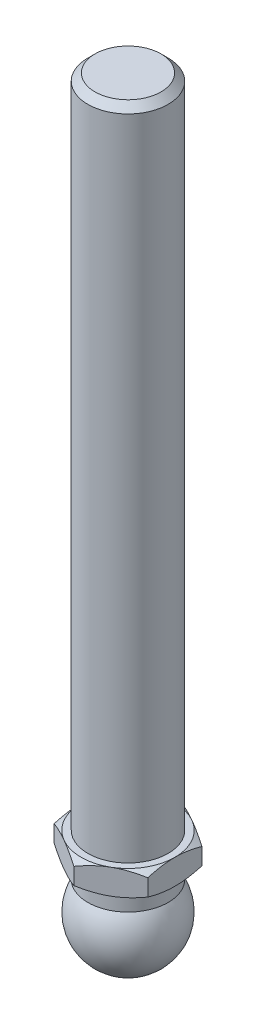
ISO-10303-21;
HEADER;
FILE_DESCRIPTION(('STEP AP214'),'2;1');
FILE_NAME('part.step','',(''),(''),'','','');
FILE_SCHEMA(('AUTOMOTIVE_DESIGN { 1 0 10303 214 1 1 1 1 }'));
ENDSEC;
DATA;
#1=APPLICATION_CONTEXT('core data for automotive mechanical design processes');
#2=APPLICATION_PROTOCOL_DEFINITION('international standard','automotive_design',2000,#1);
#3=PRODUCT_CONTEXT('',#1,'mechanical');
#4=PRODUCT('Part','Part','',(#3));
#5=PRODUCT_RELATED_PRODUCT_CATEGORY('part','',(#4));
#6=PRODUCT_DEFINITION_FORMATION('','',#4);
#7=PRODUCT_DEFINITION_CONTEXT('part definition',#1,'design');
#8=PRODUCT_DEFINITION('design','',#6,#7);
#9=PRODUCT_DEFINITION_SHAPE('','',#8);
#10=(LENGTH_UNIT() NAMED_UNIT(*) SI_UNIT(.MILLI.,.METRE.));
#11=(NAMED_UNIT(*) PLANE_ANGLE_UNIT() SI_UNIT($,.RADIAN.));
#12=(NAMED_UNIT(*) SI_UNIT($,.STERADIAN.) SOLID_ANGLE_UNIT());
#13=UNCERTAINTY_MEASURE_WITH_UNIT(LENGTH_MEASURE(1.E-05),#10,'distance_accuracy_value','');
#14=(GEOMETRIC_REPRESENTATION_CONTEXT(3) GLOBAL_UNCERTAINTY_ASSIGNED_CONTEXT((#13)) GLOBAL_UNIT_ASSIGNED_CONTEXT((#10,
#11,#12)) REPRESENTATION_CONTEXT('',''));
#15=CARTESIAN_POINT('',(0.,0.,0.));
#16=DIRECTION('',(0.,0.,1.));
#17=DIRECTION('',(1.,0.,0.));
#18=AXIS2_PLACEMENT_3D('',#15,#16,#17);
#19=CARTESIAN_POINT('',(0.,10.55,0.));
#20=DIRECTION('',(0.,-1.,0.));
#21=DIRECTION('',(0.,0.,-1.));
#22=AXIS2_PLACEMENT_3D('',#19,#20,#21);
#23=CONICAL_SURFACE('',#22,7.,1.0471975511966);
#24=CARTESIAN_POINT('',(-7.,6.48828268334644,12.1648696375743));
#25=CARTESIAN_POINT('',(-7.,6.63391573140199,11.8738003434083));
#26=CARTESIAN_POINT('',(-7.,6.77854589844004,11.5822239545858));
#27=CARTESIAN_POINT('',(-7.,7.06531569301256,10.997825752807));
#28=CARTESIAN_POINT('',(-7.,7.20745515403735,10.7050038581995));
#29=CARTESIAN_POINT('',(-7.,7.48902214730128,10.1173316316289));
#30=CARTESIAN_POINT('',(-7.,7.62844364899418,9.82247840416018));
#31=CARTESIAN_POINT('',(-7.,7.90360604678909,9.2310632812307));
#32=CARTESIAN_POINT('',(-7.,8.03934701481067,8.93450141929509));
#33=CARTESIAN_POINT('',(-7.,8.31231104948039,8.32593520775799));
#34=CARTESIAN_POINT('',(-7.,8.44932547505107,8.01383696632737));
#35=CARTESIAN_POINT('',(-7.,8.71713837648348,7.38695797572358));
#36=CARTESIAN_POINT('',(-7.,8.84793657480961,7.07217710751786));
#37=CARTESIAN_POINT('',(-7.,9.10155301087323,6.43962449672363));
#38=CARTESIAN_POINT('',(-7.,9.224376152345,6.12185473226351));
#39=CARTESIAN_POINT('',(-7.,9.45990162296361,5.48260317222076));
#40=CARTESIAN_POINT('',(-7.,9.57260505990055,5.16112178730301));
#41=CARTESIAN_POINT('',(-7.,9.80990146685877,4.43821731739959));
#42=CARTESIAN_POINT('',(-7.,9.93111814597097,4.03566892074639));
#43=CARTESIAN_POINT('',(-7.,10.1469740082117,3.22331060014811));
#44=CARTESIAN_POINT('',(-7.,10.2416155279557,2.81350131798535));
#45=CARTESIAN_POINT('',(-7.,10.3569999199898,2.19742561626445));
#46=CARTESIAN_POINT('',(-7.,10.3908518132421,1.99359214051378));
#47=CARTESIAN_POINT('',(-7.,10.4493191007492,1.58461613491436));
#48=CARTESIAN_POINT('',(-7.,10.4739358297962,1.37947379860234));
#49=CARTESIAN_POINT('',(-7.,10.5131968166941,0.968289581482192));
#50=CARTESIAN_POINT('',(-7.,10.5278439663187,0.762247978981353));
#51=CARTESIAN_POINT('',(-7.,10.5467021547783,0.349683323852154));
#52=CARTESIAN_POINT('',(-7.,10.5509132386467,0.143160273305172));
#53=CARTESIAN_POINT('',(-7.,10.5487493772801,-0.271082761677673));
#54=CARTESIAN_POINT('',(-7.,10.5423100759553,-0.478802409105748));
#55=CARTESIAN_POINT('',(-7.,10.5189433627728,-0.893645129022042));
#56=CARTESIAN_POINT('',(-7.,10.5020159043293,-1.1007681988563));
#57=CARTESIAN_POINT('',(-7.,10.4582124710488,-1.51403043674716));
#58=CARTESIAN_POINT('',(-7.,10.4313327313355,-1.72016920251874));
#59=CARTESIAN_POINT('',(-7.,10.3684180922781,-2.13103319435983));
#60=CARTESIAN_POINT('',(-7.,10.3323828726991,-2.33575837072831));
#61=CARTESIAN_POINT('',(-7.,10.2105686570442,-2.95437912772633));
#62=CARTESIAN_POINT('',(-7.,10.1118729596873,-3.3657507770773));
#63=CARTESIAN_POINT('',(-7.,9.88845338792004,-4.18138012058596));
#64=CARTESIAN_POINT('',(-7.,9.76371481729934,-4.58563365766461));
#65=CARTESIAN_POINT('',(-7.,9.52332483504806,-5.30320893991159));
#66=CARTESIAN_POINT('',(-7.,9.41128759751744,-5.61775957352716));
#67=CARTESIAN_POINT('',(-7.,9.17785144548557,-6.24325021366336));
#68=CARTESIAN_POINT('',(-7.,9.05645511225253,-6.55419118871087));
#69=CARTESIAN_POINT('',(-7.,8.80620704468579,-7.17328528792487));
#70=CARTESIAN_POINT('',(-7.,8.67735033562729,-7.48143638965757));
#71=CARTESIAN_POINT('',(-7.,8.41378231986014,-8.09523802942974));
#72=CARTESIAN_POINT('',(-7.,8.27907065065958,-8.40088841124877));
#73=CARTESIAN_POINT('',(-7.,8.01078407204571,-8.99716345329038));
#74=CARTESIAN_POINT('',(-7.,7.87740317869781,-9.28787568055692));
#75=CARTESIAN_POINT('',(-7.,7.60714715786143,-9.86766295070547));
#76=CARTESIAN_POINT('',(-7.,7.47027208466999,-10.1567380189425));
#77=CARTESIAN_POINT('',(-7.,7.19389786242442,-10.7329937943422));
#78=CARTESIAN_POINT('',(-7.,7.05440383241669,-11.0201769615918));
#79=CARTESIAN_POINT('',(-7.,6.77302286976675,-11.5933594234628));
#80=CARTESIAN_POINT('',(-7.,6.63113600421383,-11.879358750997));
#81=CARTESIAN_POINT('',(-7.,6.48828268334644,-12.1648696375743));
#82=B_SPLINE_CURVE_WITH_KNOTS('',3,(#24,#25,#26,#27,#28,#29,#30,#31,#32,#33,#34,#35,#36,#37,#38,
#39,#40,#41,#42,#43,#44,#45,#46,#47,#48,#49,#50,#51,#52,#53,#54,#55,#56,#57,#58,#59,#60,#61,#62,
#63,#64,#65,#66,#67,#68,#69,#70,#71,#72,#73,#74,#75,#76,#77,#78,#79,#80,#81),.UNSPECIFIED.,.F.,
.F.,(4,2,2,2,2,2,2,2,2,2,2,2,2,2,2,2,2,2,2,2,2,2,2,2,2,2,2,2,4),(0.,0.976413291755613,
1.95289161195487,2.93133423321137,3.90975772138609,4.93225217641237,5.95479223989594,
6.97669748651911,7.99849072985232,9.25906449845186,10.5195273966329,11.1392271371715,
11.7588372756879,12.3782676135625,12.9976952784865,13.6208795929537,14.2440666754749,
14.8674897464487,15.490934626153,16.758797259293,18.0273773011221,19.0289263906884,
20.0302002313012,21.0321496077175,22.0341611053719,22.9936838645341,23.9531917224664,
24.9109871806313,25.8687558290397),.UNSPECIFIED.);
#83=CARTESIAN_POINT('',(-7.,9.92478521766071,4.04145188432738));
#84=VERTEX_POINT('',#83);
#85=CARTESIAN_POINT('',(-7.,10.55,0.));
#86=VERTEX_POINT('',#85);
#87=EDGE_CURVE('E313',#84,#86,#82,.T.);
#88=ORIENTED_EDGE('',*,*,#87,.F.);
#89=CARTESIAN_POINT('',(0.0002,9.9247185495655,8.0830192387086));
#90=CARTESIAN_POINT('',(-0.153667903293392,9.97600015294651,7.99418356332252));
#91=CARTESIAN_POINT('',(-0.30810950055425,10.0249544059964,7.90501666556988));
#92=CARTESIAN_POINT('',(-0.618246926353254,10.1175672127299,7.72595873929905));
#93=CARTESIAN_POINT('',(-0.773943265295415,10.1612234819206,7.63606741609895));
#94=CARTESIAN_POINT('',(-1.24352516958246,10.2833884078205,7.36495417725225));
#95=CARTESIAN_POINT('',(-1.5592643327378,10.3528744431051,7.18266208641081));
#96=CARTESIAN_POINT('',(-2.03176224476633,10.4343550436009,6.9098652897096));
#97=CARTESIAN_POINT('',(-2.18710922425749,10.4575665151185,6.82017566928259));
#98=CARTESIAN_POINT('',(-2.49850511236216,10.4964887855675,6.64039116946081));
#99=CARTESIAN_POINT('',(-2.65455395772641,10.5122002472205,6.55029632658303));
#100=CARTESIAN_POINT('',(-2.96692267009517,10.5357220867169,6.36995016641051));
#101=CARTESIAN_POINT('',(-3.12324202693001,10.5435414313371,6.27969914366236));
#102=CARTESIAN_POINT('',(-3.43601650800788,10.5511197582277,6.09911871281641));
#103=CARTESIAN_POINT('',(-3.59247162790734,10.550878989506,6.00878930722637));
#104=CARTESIAN_POINT('',(-4.02110687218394,10.5391402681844,5.76131663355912));
#105=CARTESIAN_POINT('',(-4.2931466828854,10.5194342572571,5.60425437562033));
#106=CARTESIAN_POINT('',(-4.8354194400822,10.4569465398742,5.29117305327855));
#107=CARTESIAN_POINT('',(-5.10565047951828,10.414143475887,5.13515508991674));
#108=CARTESIAN_POINT('',(-5.64901454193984,10.3071483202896,4.82144370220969));
#109=CARTESIAN_POINT('',(-5.92207900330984,10.2425029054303,4.66378986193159));
#110=CARTESIAN_POINT('',(-6.46413578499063,10.095783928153,4.35083323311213));
#111=CARTESIAN_POINT('',(-6.73313504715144,10.0137448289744,4.19552643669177));
#112=CARTESIAN_POINT('',(-7.0002,9.9247185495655,4.04133641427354));
#113=B_SPLINE_CURVE_WITH_KNOTS('',3,(#89,#90,#91,#92,#93,#94,#95,#96,#97,#98,#99,#100,#101,#102,
#103,#104,#105,#106,#107,#108,#109,#110,#111,#112),.UNSPECIFIED.,.F.,.F.,(4,2,2,2,2,2,2,2,2,2,2,
4),(0.,0.554727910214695,1.10969417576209,2.2219327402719,2.76443041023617,3.30688013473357,
3.8487128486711,4.39052882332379,5.33376515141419,6.27787517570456,7.2429241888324,
8.20607866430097),.UNSPECIFIED.);
#114=CARTESIAN_POINT('',(-3.5,10.55,6.06217782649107));
#115=VERTEX_POINT('',#114);
#116=EDGE_CURVE('E135',#115,#84,#113,.T.);
#117=ORIENTED_EDGE('',*,*,#116,.F.);
#118=CARTESIAN_POINT('',(0.,10.55,0.));
#119=DIRECTION('',(0.,-1.,0.));
#120=DIRECTION('',(0.,0.,-1.));
#121=AXIS2_PLACEMENT_3D('',#118,#119,#120);
#122=CIRCLE('',#121,7.);
#123=EDGE_CURVE('E283',#115,#86,#122,.T.);
#124=ORIENTED_EDGE('',*,*,#123,.T.);
#125=EDGE_LOOP('',(#88,#117,#124));
#126=FACE_BOUND('',#125,.T.);
#127=ADVANCED_FACE('F14',(#126),#23,.T.);
#128=CARTESIAN_POINT('',(-7.,9.92478521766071,-4.04145188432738));
#129=VERTEX_POINT('',#128);
#130=EDGE_CURVE('E193',#86,#129,#82,.T.);
#131=ORIENTED_EDGE('',*,*,#130,.F.);
#132=CARTESIAN_POINT('',(-3.5,10.55,-6.06217782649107));
#133=VERTEX_POINT('',#132);
#134=EDGE_CURVE('E195',#86,#133,#122,.T.);
#135=ORIENTED_EDGE('',*,*,#134,.T.);
#136=CARTESIAN_POINT('',(-7.0002,9.9247185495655,-4.04133641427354));
#137=CARTESIAN_POINT('',(-6.84633209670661,9.97600015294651,-4.13017208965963));
#138=CARTESIAN_POINT('',(-6.69189049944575,10.0249544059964,-4.21933898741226));
#139=CARTESIAN_POINT('',(-6.38175307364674,10.1175672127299,-4.39839691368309));
#140=CARTESIAN_POINT('',(-6.22605673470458,10.1612234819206,-4.48828823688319));
#141=CARTESIAN_POINT('',(-5.75647483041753,10.2833884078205,-4.75940147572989));
#142=CARTESIAN_POINT('',(-5.4407356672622,10.352874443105,-4.94169356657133));
#143=CARTESIAN_POINT('',(-4.96823775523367,10.4343550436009,-5.21449036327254));
#144=CARTESIAN_POINT('',(-4.81289077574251,10.4575665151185,-5.30417998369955));
#145=CARTESIAN_POINT('',(-4.50149488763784,10.4964887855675,-5.48396448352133));
#146=CARTESIAN_POINT('',(-4.34544604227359,10.5122002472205,-5.57405932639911));
#147=CARTESIAN_POINT('',(-4.03307732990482,10.5357220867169,-5.75440548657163));
#148=CARTESIAN_POINT('',(-3.87675797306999,10.5435414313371,-5.84465650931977));
#149=CARTESIAN_POINT('',(-3.56398349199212,10.5511197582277,-6.02523694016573));
#150=CARTESIAN_POINT('',(-3.40752837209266,10.550878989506,-6.11556634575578));
#151=CARTESIAN_POINT('',(-2.97889312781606,10.5391402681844,-6.36303901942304));
#152=CARTESIAN_POINT('',(-2.7068533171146,10.5194342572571,-6.52010127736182));
#153=CARTESIAN_POINT('',(-2.1645805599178,10.4569465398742,-6.83318259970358));
#154=CARTESIAN_POINT('',(-1.89434952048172,10.414143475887,-6.9892005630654));
#155=CARTESIAN_POINT('',(-1.35098545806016,10.3071483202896,-7.30291195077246));
#156=CARTESIAN_POINT('',(-1.07792099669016,10.2425029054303,-7.46056579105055));
#157=CARTESIAN_POINT('',(-0.53586421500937,10.095783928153,-7.77352241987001));
#158=CARTESIAN_POINT('',(-0.266864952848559,10.0137448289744,-7.92882921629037));
#159=CARTESIAN_POINT('',(0.000199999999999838,9.9247185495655,-8.0830192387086));
#160=B_SPLINE_CURVE_WITH_KNOTS('',3,(#136,#137,#138,#139,#140,#141,#142,#143,#144,#145,#146,
#147,#148,#149,#150,#151,#152,#153,#154,#155,#156,#157,#158,#159),.UNSPECIFIED.,.F.,.F.,(4,2,2,
2,2,2,2,2,2,2,2,4),(0.,0.554727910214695,1.10969417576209,2.2219327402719,2.76443041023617,
3.30688013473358,3.8487128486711,4.39052882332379,5.33376515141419,6.27787517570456,
7.2429241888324,8.20607866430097),.UNSPECIFIED.);
#161=EDGE_CURVE('E183',#129,#133,#160,.T.);
#162=ORIENTED_EDGE('',*,*,#161,.F.);
#163=EDGE_LOOP('',(#131,#135,#162));
#164=FACE_BOUND('',#163,.T.);
#165=ADVANCED_FACE('F192',(#164),#23,.T.);
#166=CARTESIAN_POINT('',(0.,9.92478521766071,-8.08290376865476));
#167=VERTEX_POINT('',#166);
#168=EDGE_CURVE('E197',#133,#167,#160,.T.);
#169=ORIENTED_EDGE('',*,*,#168,.F.);
#170=CARTESIAN_POINT('',(3.5,10.55,-6.06217782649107));
#171=VERTEX_POINT('',#170);
#172=EDGE_CURVE('E293',#133,#171,#122,.T.);
#173=ORIENTED_EDGE('',*,*,#172,.T.);
#174=CARTESIAN_POINT('',(-0.0002,9.9247185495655,-8.0830192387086));
#175=CARTESIAN_POINT('',(0.153667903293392,9.97600015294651,-7.99418356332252));
#176=CARTESIAN_POINT('',(0.30810950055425,10.0249544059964,-7.90501666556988));
#177=CARTESIAN_POINT('',(0.618246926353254,10.1175672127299,-7.72595873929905));
#178=CARTESIAN_POINT('',(0.773943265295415,10.1612234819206,-7.63606741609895));
#179=CARTESIAN_POINT('',(1.24352516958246,10.2833884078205,-7.36495417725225));
#180=CARTESIAN_POINT('',(1.5592643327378,10.3528744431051,-7.18266208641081));
#181=CARTESIAN_POINT('',(2.03176224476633,10.4343550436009,-6.9098652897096));
#182=CARTESIAN_POINT('',(2.18710922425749,10.4575665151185,-6.82017566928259));
#183=CARTESIAN_POINT('',(2.49850511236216,10.4964887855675,-6.64039116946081));
#184=CARTESIAN_POINT('',(2.65455395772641,10.5122002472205,-6.55029632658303));
#185=CARTESIAN_POINT('',(2.96692267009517,10.5357220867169,-6.36995016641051));
#186=CARTESIAN_POINT('',(3.12324202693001,10.5435414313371,-6.27969914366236));
#187=CARTESIAN_POINT('',(3.43601650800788,10.5511197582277,-6.09911871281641));
#188=CARTESIAN_POINT('',(3.59247162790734,10.550878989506,-6.00878930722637));
#189=CARTESIAN_POINT('',(4.02110687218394,10.5391402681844,-5.76131663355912));
#190=CARTESIAN_POINT('',(4.2931466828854,10.5194342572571,-5.60425437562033));
#191=CARTESIAN_POINT('',(4.8354194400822,10.4569465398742,-5.29117305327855));
#192=CARTESIAN_POINT('',(5.10565047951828,10.414143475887,-5.13515508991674));
#193=CARTESIAN_POINT('',(5.64901454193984,10.3071483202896,-4.82144370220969));
#194=CARTESIAN_POINT('',(5.92207900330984,10.2425029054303,-4.66378986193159));
#195=CARTESIAN_POINT('',(6.46413578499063,10.095783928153,-4.35083323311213));
#196=CARTESIAN_POINT('',(6.73313504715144,10.0137448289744,-4.19552643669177));
#197=CARTESIAN_POINT('',(7.0002,9.9247185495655,-4.04133641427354));
#198=B_SPLINE_CURVE_WITH_KNOTS('',3,(#174,#175,#176,#177,#178,#179,#180,#181,#182,#183,#184,
#185,#186,#187,#188,#189,#190,#191,#192,#193,#194,#195,#196,#197),.UNSPECIFIED.,.F.,.F.,(4,2,2,
2,2,2,2,2,2,2,2,4),(0.,0.554727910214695,1.10969417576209,2.2219327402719,2.76443041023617,
3.30688013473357,3.8487128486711,4.39052882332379,5.33376515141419,6.27787517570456,
7.2429241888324,8.20607866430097),.UNSPECIFIED.);
#199=EDGE_CURVE('E243',#167,#171,#198,.T.);
#200=ORIENTED_EDGE('',*,*,#199,.F.);
#201=EDGE_LOOP('',(#169,#173,#200));
#202=FACE_BOUND('',#201,.T.);
#203=ADVANCED_FACE('F346',(#202),#23,.T.);
#204=CARTESIAN_POINT('',(7.,9.92478521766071,-4.04145188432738));
#205=VERTEX_POINT('',#204);
#206=EDGE_CURVE('E238',#171,#205,#198,.T.);
#207=ORIENTED_EDGE('',*,*,#206,.F.);
#208=CARTESIAN_POINT('',(7.,10.55,0.));
#209=VERTEX_POINT('',#208);
#210=EDGE_CURVE('E288',#171,#209,#122,.T.);
#211=ORIENTED_EDGE('',*,*,#210,.T.);
#212=CARTESIAN_POINT('',(7.,6.48828268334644,-12.1648696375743));
#213=CARTESIAN_POINT('',(7.,6.63391573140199,-11.8738003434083));
#214=CARTESIAN_POINT('',(7.,6.77854589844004,-11.5822239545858));
#215=CARTESIAN_POINT('',(7.,7.06531569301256,-10.997825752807));
#216=CARTESIAN_POINT('',(7.,7.20745515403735,-10.7050038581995));
#217=CARTESIAN_POINT('',(7.,7.48902214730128,-10.1173316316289));
#218=CARTESIAN_POINT('',(7.,7.62844364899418,-9.82247840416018));
#219=CARTESIAN_POINT('',(7.,7.90360604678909,-9.2310632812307));
#220=CARTESIAN_POINT('',(7.,8.03934701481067,-8.93450141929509));
#221=CARTESIAN_POINT('',(7.,8.31231104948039,-8.32593520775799));
#222=CARTESIAN_POINT('',(7.,8.44932547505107,-8.01383696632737));
#223=CARTESIAN_POINT('',(7.,8.71713837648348,-7.38695797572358));
#224=CARTESIAN_POINT('',(7.,8.84793657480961,-7.07217710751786));
#225=CARTESIAN_POINT('',(7.,9.10155301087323,-6.43962449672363));
#226=CARTESIAN_POINT('',(7.,9.224376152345,-6.12185473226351));
#227=CARTESIAN_POINT('',(7.,9.45990162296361,-5.48260317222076));
#228=CARTESIAN_POINT('',(7.,9.57260505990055,-5.16112178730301));
#229=CARTESIAN_POINT('',(7.,9.80990146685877,-4.43821731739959));
#230=CARTESIAN_POINT('',(7.,9.93111814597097,-4.03566892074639));
#231=CARTESIAN_POINT('',(7.,10.1469740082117,-3.22331060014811));
#232=CARTESIAN_POINT('',(7.,10.2416155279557,-2.81350131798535));
#233=CARTESIAN_POINT('',(7.,10.3569999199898,-2.19742561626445));
#234=CARTESIAN_POINT('',(7.,10.3908518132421,-1.99359214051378));
#235=CARTESIAN_POINT('',(7.,10.4493191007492,-1.58461613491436));
#236=CARTESIAN_POINT('',(7.,10.4739358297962,-1.37947379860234));
#237=CARTESIAN_POINT('',(7.,10.5131968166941,-0.968289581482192));
#238=CARTESIAN_POINT('',(7.,10.5278439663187,-0.762247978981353));
#239=CARTESIAN_POINT('',(7.,10.5467021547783,-0.349683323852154));
#240=CARTESIAN_POINT('',(7.,10.5509132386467,-0.143160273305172));
#241=CARTESIAN_POINT('',(7.,10.5487493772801,0.271082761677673));
#242=CARTESIAN_POINT('',(7.,10.5423100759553,0.478802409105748));
#243=CARTESIAN_POINT('',(7.,10.5189433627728,0.893645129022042));
#244=CARTESIAN_POINT('',(7.,10.5020159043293,1.1007681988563));
#245=CARTESIAN_POINT('',(7.,10.4582124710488,1.51403043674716));
#246=CARTESIAN_POINT('',(7.,10.4313327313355,1.72016920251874));
#247=CARTESIAN_POINT('',(7.,10.3684180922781,2.13103319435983));
#248=CARTESIAN_POINT('',(7.,10.3323828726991,2.33575837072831));
#249=CARTESIAN_POINT('',(7.,10.2105686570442,2.95437912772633));
#250=CARTESIAN_POINT('',(7.,10.1118729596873,3.3657507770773));
#251=CARTESIAN_POINT('',(7.,9.88845338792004,4.18138012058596));
#252=CARTESIAN_POINT('',(7.,9.76371481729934,4.58563365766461));
#253=CARTESIAN_POINT('',(7.,9.52332483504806,5.30320893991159));
#254=CARTESIAN_POINT('',(7.,9.41128759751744,5.61775957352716));
#255=CARTESIAN_POINT('',(7.,9.17785144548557,6.24325021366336));
#256=CARTESIAN_POINT('',(7.,9.05645511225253,6.55419118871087));
#257=CARTESIAN_POINT('',(7.,8.80620704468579,7.17328528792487));
#258=CARTESIAN_POINT('',(7.,8.67735033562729,7.48143638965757));
#259=CARTESIAN_POINT('',(7.,8.41378231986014,8.09523802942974));
#260=CARTESIAN_POINT('',(7.,8.27907065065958,8.40088841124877));
#261=CARTESIAN_POINT('',(7.,8.01078407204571,8.99716345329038));
#262=CARTESIAN_POINT('',(7.,7.87740317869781,9.28787568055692));
#263=CARTESIAN_POINT('',(7.,7.60714715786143,9.86766295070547));
#264=CARTESIAN_POINT('',(7.,7.47027208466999,10.1567380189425));
#265=CARTESIAN_POINT('',(7.,7.19389786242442,10.7329937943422));
#266=CARTESIAN_POINT('',(7.,7.05440383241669,11.0201769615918));
#267=CARTESIAN_POINT('',(7.,6.77302286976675,11.5933594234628));
#268=CARTESIAN_POINT('',(7.,6.63113600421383,11.879358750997));
#269=CARTESIAN_POINT('',(7.,6.48828268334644,12.1648696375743));
#270=B_SPLINE_CURVE_WITH_KNOTS('',3,(#212,#213,#214,#215,#216,#217,#218,#219,#220,#221,#222,
#223,#224,#225,#226,#227,#228,#229,#230,#231,#232,#233,#234,#235,#236,#237,#238,#239,#240,#241,
#242,#243,#244,#245,#246,#247,#248,#249,#250,#251,#252,#253,#254,#255,#256,#257,#258,#259,#260,
#261,#262,#263,#264,#265,#266,#267,#268,#269),.UNSPECIFIED.,.F.,.F.,(4,2,2,2,2,2,2,2,2,2,2,2,2,
2,2,2,2,2,2,2,2,2,2,2,2,2,2,2,4),(0.,0.976413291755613,1.95289161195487,2.93133423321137,
3.90975772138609,4.93225217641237,5.95479223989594,6.97669748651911,7.99849072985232,
9.25906449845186,10.5195273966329,11.1392271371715,11.7588372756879,12.3782676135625,
12.9976952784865,13.6208795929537,14.2440666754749,14.8674897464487,15.490934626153,
16.758797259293,18.0273773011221,19.0289263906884,20.0302002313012,21.0321496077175,
22.0341611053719,22.9936838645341,23.9531917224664,24.9109871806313,25.8687558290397),.UNSPECIFIED.);
#271=EDGE_CURVE('E249',#205,#209,#270,.T.);
#272=ORIENTED_EDGE('',*,*,#271,.F.);
#273=EDGE_LOOP('',(#207,#211,#272));
#274=FACE_BOUND('',#273,.T.);
#275=ADVANCED_FACE('F356',(#274),#23,.T.);
#276=CARTESIAN_POINT('',(7.,9.92478521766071,4.04145188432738));
#277=VERTEX_POINT('',#276);
#278=EDGE_CURVE('E251',#209,#277,#270,.T.);
#279=ORIENTED_EDGE('',*,*,#278,.F.);
#280=CARTESIAN_POINT('',(3.5,10.55,6.06217782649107));
#281=VERTEX_POINT('',#280);
#282=EDGE_CURVE('E281',#209,#281,#122,.T.);
#283=ORIENTED_EDGE('',*,*,#282,.T.);
#284=CARTESIAN_POINT('',(7.0002,9.9247185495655,4.04133641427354));
#285=CARTESIAN_POINT('',(6.84633209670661,9.97600015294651,4.13017208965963));
#286=CARTESIAN_POINT('',(6.69189049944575,10.0249544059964,4.21933898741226));
#287=CARTESIAN_POINT('',(6.38175307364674,10.1175672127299,4.39839691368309));
#288=CARTESIAN_POINT('',(6.22605673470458,10.1612234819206,4.48828823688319));
#289=CARTESIAN_POINT('',(5.75647483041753,10.2833884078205,4.75940147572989));
#290=CARTESIAN_POINT('',(5.4407356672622,10.352874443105,4.94169356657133));
#291=CARTESIAN_POINT('',(4.96823775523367,10.4343550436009,5.21449036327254));
#292=CARTESIAN_POINT('',(4.81289077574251,10.4575665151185,5.30417998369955));
#293=CARTESIAN_POINT('',(4.50149488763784,10.4964887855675,5.48396448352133));
#294=CARTESIAN_POINT('',(4.34544604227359,10.5122002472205,5.57405932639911));
#295=CARTESIAN_POINT('',(4.03307732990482,10.5357220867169,5.75440548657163));
#296=CARTESIAN_POINT('',(3.87675797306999,10.5435414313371,5.84465650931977));
#297=CARTESIAN_POINT('',(3.56398349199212,10.5511197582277,6.02523694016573));
#298=CARTESIAN_POINT('',(3.40752837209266,10.550878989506,6.11556634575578));
#299=CARTESIAN_POINT('',(2.97889312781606,10.5391402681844,6.36303901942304));
#300=CARTESIAN_POINT('',(2.7068533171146,10.5194342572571,6.52010127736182));
#301=CARTESIAN_POINT('',(2.1645805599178,10.4569465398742,6.83318259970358));
#302=CARTESIAN_POINT('',(1.89434952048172,10.414143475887,6.9892005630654));
#303=CARTESIAN_POINT('',(1.35098545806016,10.3071483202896,7.30291195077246));
#304=CARTESIAN_POINT('',(1.07792099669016,10.2425029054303,7.46056579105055));
#305=CARTESIAN_POINT('',(0.53586421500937,10.095783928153,7.77352241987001));
#306=CARTESIAN_POINT('',(0.266864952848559,10.0137448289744,7.92882921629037));
#307=CARTESIAN_POINT('',(-0.000199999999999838,9.9247185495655,8.0830192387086));
#308=B_SPLINE_CURVE_WITH_KNOTS('',3,(#284,#285,#286,#287,#288,#289,#290,#291,#292,#293,#294,
#295,#296,#297,#298,#299,#300,#301,#302,#303,#304,#305,#306,#307),.UNSPECIFIED.,.F.,.F.,(4,2,2,
2,2,2,2,2,2,2,2,4),(0.,0.554727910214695,1.10969417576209,2.2219327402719,2.76443041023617,
3.30688013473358,3.8487128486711,4.39052882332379,5.33376515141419,6.27787517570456,
7.2429241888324,8.20607866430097),.UNSPECIFIED.);
#309=EDGE_CURVE('E126',#277,#281,#308,.T.);
#310=ORIENTED_EDGE('',*,*,#309,.F.);
#311=EDGE_LOOP('',(#279,#283,#310));
#312=FACE_BOUND('',#311,.T.);
#313=ADVANCED_FACE('F285',(#312),#23,.T.);
#314=CARTESIAN_POINT('',(0.,9.92478521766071,8.08290376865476));
#315=VERTEX_POINT('',#314);
#316=EDGE_CURVE('E116',#281,#315,#308,.T.);
#317=ORIENTED_EDGE('',*,*,#316,.F.);
#318=EDGE_CURVE('E274',#281,#115,#122,.T.);
#319=ORIENTED_EDGE('',*,*,#318,.T.);
#320=EDGE_CURVE('E29',#315,#115,#113,.T.);
#321=ORIENTED_EDGE('',*,*,#320,.F.);
#322=EDGE_LOOP('',(#317,#319,#321));
#323=FACE_BOUND('',#322,.T.);
#324=ADVANCED_FACE('F273',(#323),#23,.T.);
#325=CARTESIAN_POINT('',(0.,108.55,0.));
#326=DIRECTION('',(0.,-1.,0.));
#327=DIRECTION('',(0.,0.,-1.));
#328=AXIS2_PLACEMENT_3D('',#325,#326,#327);
#329=PLANE('',#328);
#330=CARTESIAN_POINT('',(0.,108.55,0.));
#331=DIRECTION('',(0.,-1.,0.));
#332=DIRECTION('',(0.,0.,-1.));
#333=AXIS2_PLACEMENT_3D('',#330,#331,#332);
#334=CIRCLE('',#333,4.9265);
#335=CARTESIAN_POINT('',(0.,108.55,-4.9265));
#336=VERTEX_POINT('',#335);
#337=EDGE_CURVE('E22',#336,#336,#334,.T.);
#338=ORIENTED_EDGE('',*,*,#337,.F.);
#339=EDGE_LOOP('',(#338));
#340=FACE_BOUND('',#339,.T.);
#341=ADVANCED_FACE('F16',(#340),#329,.F.);
#342=CARTESIAN_POINT('',(0.,108.55,0.));
#343=DIRECTION('',(0.,-1.,0.));
#344=DIRECTION('',(0.,0.,-1.));
#345=AXIS2_PLACEMENT_3D('',#342,#343,#344);
#346=CONICAL_SURFACE('',#345,4.9265,0.785398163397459);
#347=CARTESIAN_POINT('',(0.,107.4765,0.));
#348=DIRECTION('',(0.,-1.,0.));
#349=DIRECTION('',(0.,0.,-1.));
#350=AXIS2_PLACEMENT_3D('',#347,#348,#349);
#351=CIRCLE('',#350,6.);
#352=CARTESIAN_POINT('',(0.,107.4765,-6.));
#353=VERTEX_POINT('',#352);
#354=EDGE_CURVE('E290',#353,#353,#351,.T.);
#355=ORIENTED_EDGE('',*,*,#354,.F.);
#356=EDGE_LOOP('',(#355));
#357=FACE_BOUND('',#356,.T.);
#358=ORIENTED_EDGE('',*,*,#337,.T.);
#359=EDGE_LOOP('',(#358));
#360=FACE_BOUND('',#359,.T.);
#361=ADVANCED_FACE('F354',(#357,#360),#346,.T.);
#362=CARTESIAN_POINT('',(0.,-7.,0.));
#363=DIRECTION('',(0.,-1.,0.));
#364=DIRECTION('',(0.,0.,-1.));
#365=AXIS2_PLACEMENT_3D('',#362,#363,#364);
#366=CYLINDRICAL_SURFACE('',#365,6.);
#367=CARTESIAN_POINT('',(0.,10.55,0.));
#368=DIRECTION('',(0.,-1.,0.));
#369=DIRECTION('',(0.,0.,-1.));
#370=AXIS2_PLACEMENT_3D('',#367,#368,#369);
#371=CIRCLE('',#370,6.);
#372=CARTESIAN_POINT('',(0.,10.55,-6.));
#373=VERTEX_POINT('',#372);
#374=EDGE_CURVE('E287',#373,#373,#371,.T.);
#375=ORIENTED_EDGE('',*,*,#374,.F.);
#376=EDGE_LOOP('',(#375));
#377=FACE_BOUND('',#376,.T.);
#378=ORIENTED_EDGE('',*,*,#354,.T.);
#379=EDGE_LOOP('',(#378));
#380=FACE_BOUND('',#379,.T.);
#381=ADVANCED_FACE('F439',(#377,#380),#366,.T.);
#382=CARTESIAN_POINT('',(6.,10.55,0.));
#383=DIRECTION('',(0.,-1.,0.));
#384=DIRECTION('',(0.,0.,-1.));
#385=AXIS2_PLACEMENT_3D('',#382,#383,#384);
#386=PLANE('',#385);
#387=ORIENTED_EDGE('',*,*,#282,.F.);
#388=ORIENTED_EDGE('',*,*,#210,.F.);
#389=ORIENTED_EDGE('',*,*,#172,.F.);
#390=ORIENTED_EDGE('',*,*,#134,.F.);
#391=ORIENTED_EDGE('',*,*,#123,.F.);
#392=ORIENTED_EDGE('',*,*,#318,.F.);
#393=EDGE_LOOP('',(#387,#388,#389,#390,#391,#392));
#394=FACE_BOUND('',#393,.T.);
#395=ORIENTED_EDGE('',*,*,#374,.T.);
#396=EDGE_LOOP('',(#395));
#397=FACE_BOUND('',#396,.T.);
#398=ADVANCED_FACE('F278',(#394,#397),#386,.F.);
#399=CARTESIAN_POINT('',(-7.,6.8,-4.04145188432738));
#400=DIRECTION('',(-1.,0.,0.));
#401=DIRECTION('',(0.,0.,1.));
#402=AXIS2_PLACEMENT_3D('',#399,#400,#401);
#403=PLANE('',#402);
#404=ORIENTED_EDGE('',*,*,#87,.T.);
#405=ORIENTED_EDGE('',*,*,#130,.T.);
#406=DIRECTION('',(0.,1.,0.));
#407=VECTOR('',#406,1.);
#408=CARTESIAN_POINT('',(-7.,6.8,-4.04145188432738));
#409=LINE('',#408,#407);
#410=CARTESIAN_POINT('',(-7.,7.42521478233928,-4.04145188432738));
#411=VERTEX_POINT('',#410);
#412=EDGE_CURVE('E109',#411,#129,#409,.T.);
#413=ORIENTED_EDGE('',*,*,#412,.F.);
#414=CARTESIAN_POINT('',(-7.,10.8617173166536,-12.1648696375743));
#415=CARTESIAN_POINT('',(-7.,10.716084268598,-11.8738003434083));
#416=CARTESIAN_POINT('',(-7.,10.57145410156,-11.5822239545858));
#417=CARTESIAN_POINT('',(-7.,10.2846843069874,-10.997825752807));
#418=CARTESIAN_POINT('',(-7.,10.1425448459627,-10.7050038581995));
#419=CARTESIAN_POINT('',(-7.,9.86097785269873,-10.1173316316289));
#420=CARTESIAN_POINT('',(-7.,9.72155635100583,-9.82247840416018));
#421=CARTESIAN_POINT('',(-7.,9.44639395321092,-9.2310632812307));
#422=CARTESIAN_POINT('',(-7.,9.31065298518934,-8.93450141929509));
#423=CARTESIAN_POINT('',(-7.,9.03768895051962,-8.32593520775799));
#424=CARTESIAN_POINT('',(-7.,8.90067452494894,-8.01383696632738));
#425=CARTESIAN_POINT('',(-7.,8.63286162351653,-7.3869579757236));
#426=CARTESIAN_POINT('',(-7.,8.5020634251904,-7.07217710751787));
#427=CARTESIAN_POINT('',(-7.,8.24844698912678,-6.43962449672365));
#428=CARTESIAN_POINT('',(-7.,8.12562384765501,-6.12185473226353));
#429=CARTESIAN_POINT('',(-7.,7.8900983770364,-5.48260317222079));
#430=CARTESIAN_POINT('',(-7.,7.77739494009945,-5.16112178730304));
#431=CARTESIAN_POINT('',(-7.,7.54009853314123,-4.43821731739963));
#432=CARTESIAN_POINT('',(-7.,7.41888185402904,-4.03566892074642));
#433=CARTESIAN_POINT('',(-7.,7.20302599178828,-3.22331060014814));
#434=CARTESIAN_POINT('',(-7.,7.10838447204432,-2.81350131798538));
#435=CARTESIAN_POINT('',(-7.,6.99300008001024,-2.19742561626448));
#436=CARTESIAN_POINT('',(-7.,6.95914818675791,-1.99359214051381));
#437=CARTESIAN_POINT('',(-7.,6.90068089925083,-1.5846161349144));
#438=CARTESIAN_POINT('',(-7.,6.8760641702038,-1.37947379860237));
#439=CARTESIAN_POINT('',(-7.,6.83680318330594,-0.968289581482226));
#440=CARTESIAN_POINT('',(-7.,6.82215603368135,-0.762247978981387));
#441=CARTESIAN_POINT('',(-7.,6.80329784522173,-0.349683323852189));
#442=CARTESIAN_POINT('',(-7.,6.79908676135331,-0.143160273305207));
#443=CARTESIAN_POINT('',(-7.,6.80125062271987,0.271082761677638));
#444=CARTESIAN_POINT('',(-7.,6.80768992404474,0.478802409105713));
#445=CARTESIAN_POINT('',(-7.,6.83105663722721,0.893645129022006));
#446=CARTESIAN_POINT('',(-7.,6.84798409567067,1.10076819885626));
#447=CARTESIAN_POINT('',(-7.,6.89178752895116,1.51403043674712));
#448=CARTESIAN_POINT('',(-7.,6.91866726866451,1.7201692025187));
#449=CARTESIAN_POINT('',(-7.,6.98158190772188,2.13103319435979));
#450=CARTESIAN_POINT('',(-7.,7.01761712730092,2.33575837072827));
#451=CARTESIAN_POINT('',(-7.,7.13943134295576,2.95437912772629));
#452=CARTESIAN_POINT('',(-7.,7.23812704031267,3.36575077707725));
#453=CARTESIAN_POINT('',(-7.,7.46154661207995,4.18138012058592));
#454=CARTESIAN_POINT('',(-7.,7.58628518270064,4.58563365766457));
#455=CARTESIAN_POINT('',(-7.,7.82667516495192,5.30320893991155));
#456=CARTESIAN_POINT('',(-7.,7.93871240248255,5.61775957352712));
#457=CARTESIAN_POINT('',(-7.,8.17214855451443,6.24325021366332));
#458=CARTESIAN_POINT('',(-7.,8.29354488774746,6.55419118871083));
#459=CARTESIAN_POINT('',(-7.,8.5437929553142,7.17328528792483));
#460=CARTESIAN_POINT('',(-7.,8.6726496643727,7.48143638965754));
#461=CARTESIAN_POINT('',(-7.,8.93621768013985,8.09523802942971));
#462=CARTESIAN_POINT('',(-7.,9.07092934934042,8.40088841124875));
#463=CARTESIAN_POINT('',(-7.,9.33921592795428,8.99716345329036));
#464=CARTESIAN_POINT('',(-7.,9.47259682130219,9.2878756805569));
#465=CARTESIAN_POINT('',(-7.,9.74285284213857,9.86766295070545));
#466=CARTESIAN_POINT('',(-7.,9.87972791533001,10.1567380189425));
#467=CARTESIAN_POINT('',(-7.,10.1561021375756,10.7329937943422));
#468=CARTESIAN_POINT('',(-7.,10.2955961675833,11.0201769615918));
#469=CARTESIAN_POINT('',(-7.,10.5769771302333,11.5933594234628));
#470=CARTESIAN_POINT('',(-7.,10.7188639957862,11.879358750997));
#471=CARTESIAN_POINT('',(-7.,10.8617173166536,12.1648696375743));
#472=B_SPLINE_CURVE_WITH_KNOTS('',3,(#414,#415,#416,#417,#418,#419,#420,#421,#422,#423,#424,
#425,#426,#427,#428,#429,#430,#431,#432,#433,#434,#435,#436,#437,#438,#439,#440,#441,#442,#443,
#444,#445,#446,#447,#448,#449,#450,#451,#452,#453,#454,#455,#456,#457,#458,#459,#460,#461,#462,
#463,#464,#465,#466,#467,#468,#469,#470,#471),.UNSPECIFIED.,.F.,.F.,(4,2,2,2,2,2,2,2,2,2,2,2,2,
2,2,2,2,2,2,2,2,2,2,2,2,2,2,2,4),(0.,0.976413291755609,1.95289161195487,2.93133423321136,
3.90975772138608,4.93225217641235,5.95479223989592,6.97669748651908,7.99849072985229,
9.25906449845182,10.5195273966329,11.1392271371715,11.7588372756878,12.3782676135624,
12.9976952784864,13.6208795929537,14.2440666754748,14.8674897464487,15.490934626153,
16.758797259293,18.027377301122,19.0289263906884,20.0302002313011,21.0321496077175,
22.0341611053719,22.9936838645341,23.9531917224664,24.9109871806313,25.8687558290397),.UNSPECIFIED.);
#473=CARTESIAN_POINT('',(-7.,6.8,0.));
#474=VERTEX_POINT('',#473);
#475=EDGE_CURVE('E199',#411,#474,#472,.T.);
#476=ORIENTED_EDGE('',*,*,#475,.T.);
#477=CARTESIAN_POINT('',(-7.,7.42521478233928,4.04145188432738));
#478=VERTEX_POINT('',#477);
#479=EDGE_CURVE('E196',#474,#478,#472,.T.);
#480=ORIENTED_EDGE('',*,*,#479,.T.);
#481=DIRECTION('',(0.,1.,0.));
#482=VECTOR('',#481,1.);
#483=CARTESIAN_POINT('',(-7.,6.8,4.04145188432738));
#484=LINE('',#483,#482);
#485=EDGE_CURVE('E118',#478,#84,#484,.T.);
#486=ORIENTED_EDGE('',*,*,#485,.T.);
#487=EDGE_LOOP('',(#404,#405,#413,#476,#480,#486));
#488=FACE_BOUND('',#487,.T.);
#489=ADVANCED_FACE('F224',(#488),#403,.T.);
#490=CARTESIAN_POINT('',(0.,6.8,-8.08290376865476));
#491=DIRECTION('',(-0.5,0.,-0.866025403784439));
#492=DIRECTION('',(-0.866025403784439,0.,0.5));
#493=AXIS2_PLACEMENT_3D('',#490,#491,#492);
#494=PLANE('',#493);
#495=ORIENTED_EDGE('',*,*,#161,.T.);
#496=ORIENTED_EDGE('',*,*,#168,.T.);
#497=DIRECTION('',(0.,1.,0.));
#498=VECTOR('',#497,1.);
#499=CARTESIAN_POINT('',(0.,6.8,-8.08290376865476));
#500=LINE('',#499,#498);
#501=CARTESIAN_POINT('',(0.,7.42521478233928,-8.08290376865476));
#502=VERTEX_POINT('',#501);
#503=EDGE_CURVE('E175',#502,#167,#500,.T.);
#504=ORIENTED_EDGE('',*,*,#503,.F.);
#505=CARTESIAN_POINT('',(0.0002,7.4252814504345,-8.0830192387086));
#506=CARTESIAN_POINT('',(-0.153667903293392,7.37399984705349,-7.99418356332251));
#507=CARTESIAN_POINT('',(-0.308109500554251,7.32504559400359,-7.90501666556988));
#508=CARTESIAN_POINT('',(-0.618246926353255,7.23243278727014,-7.72595873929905));
#509=CARTESIAN_POINT('',(-0.773943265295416,7.18877651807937,-7.63606741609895));
#510=CARTESIAN_POINT('',(-1.24352516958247,7.0666115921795,-7.36495417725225));
#511=CARTESIAN_POINT('',(-1.5592643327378,6.99712555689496,-7.18266208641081));
#512=CARTESIAN_POINT('',(-2.03176224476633,6.9156449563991,-6.9098652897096));
#513=CARTESIAN_POINT('',(-2.18710922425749,6.89243348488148,-6.82017566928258));
#514=CARTESIAN_POINT('',(-2.49850511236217,6.85351121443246,-6.64039116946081));
#515=CARTESIAN_POINT('',(-2.65455395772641,6.83779975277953,-6.55029632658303));
#516=CARTESIAN_POINT('',(-2.96692267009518,6.81427791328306,-6.36995016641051));
#517=CARTESIAN_POINT('',(-3.12324202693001,6.80645856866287,-6.27969914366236));
#518=CARTESIAN_POINT('',(-3.43601650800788,6.79888024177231,-6.09911871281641));
#519=CARTESIAN_POINT('',(-3.59247162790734,6.79912101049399,-6.00878930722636));
#520=CARTESIAN_POINT('',(-4.02110687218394,6.8108597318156,-5.76131663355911));
#521=CARTESIAN_POINT('',(-4.2931466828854,6.83056574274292,-5.60425437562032));
#522=CARTESIAN_POINT('',(-4.8354194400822,6.89305346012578,-5.29117305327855));
#523=CARTESIAN_POINT('',(-5.10565047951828,6.93585652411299,-5.13515508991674));
#524=CARTESIAN_POINT('',(-5.64901454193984,7.04285167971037,-4.82144370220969));
#525=CARTESIAN_POINT('',(-5.92207900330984,7.10749709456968,-4.66378986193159));
#526=CARTESIAN_POINT('',(-6.46413578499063,7.25421607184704,-4.35083323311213));
#527=CARTESIAN_POINT('',(-6.73313504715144,7.33625517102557,-4.19552643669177));
#528=CARTESIAN_POINT('',(-7.0002,7.4252814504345,-4.04133641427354));
#529=B_SPLINE_CURVE_WITH_KNOTS('',3,(#505,#506,#507,#508,#509,#510,#511,#512,#513,#514,#515,
#516,#517,#518,#519,#520,#521,#522,#523,#524,#525,#526,#527,#528),.UNSPECIFIED.,.F.,.F.,(4,2,2,
2,2,2,2,2,2,2,2,4),(0.,0.554727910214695,1.10969417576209,2.2219327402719,2.76443041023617,
3.30688013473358,3.8487128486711,4.39052882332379,5.33376515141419,6.27787517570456,
7.2429241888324,8.20607866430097),.UNSPECIFIED.);
#530=CARTESIAN_POINT('',(-3.5,6.8,-6.06217782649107));
#531=VERTEX_POINT('',#530);
#532=EDGE_CURVE('E201',#502,#531,#529,.T.);
#533=ORIENTED_EDGE('',*,*,#532,.T.);
#534=EDGE_CURVE('E186',#531,#411,#529,.T.);
#535=ORIENTED_EDGE('',*,*,#534,.T.);
#536=ORIENTED_EDGE('',*,*,#412,.T.);
#537=EDGE_LOOP('',(#495,#496,#504,#533,#535,#536));
#538=FACE_BOUND('',#537,.T.);
#539=ADVANCED_FACE('F182',(#538),#494,.T.);
#540=CARTESIAN_POINT('',(7.,6.8,-4.04145188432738));
#541=DIRECTION('',(0.5,0.,-0.866025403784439));
#542=DIRECTION('',(-0.866025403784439,0.,-0.5));
#543=AXIS2_PLACEMENT_3D('',#540,#541,#542);
#544=PLANE('',#543);
#545=ORIENTED_EDGE('',*,*,#199,.T.);
#546=ORIENTED_EDGE('',*,*,#206,.T.);
#547=DIRECTION('',(0.,1.,0.));
#548=VECTOR('',#547,1.);
#549=CARTESIAN_POINT('',(7.,6.8,-4.04145188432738));
#550=LINE('',#549,#548);
#551=CARTESIAN_POINT('',(7.,7.42521478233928,-4.04145188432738));
#552=VERTEX_POINT('',#551);
#553=EDGE_CURVE('E172',#552,#205,#550,.T.);
#554=ORIENTED_EDGE('',*,*,#553,.F.);
#555=CARTESIAN_POINT('',(7.0002,7.4252814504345,-4.04133641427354));
#556=CARTESIAN_POINT('',(6.84633209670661,7.37399984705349,-4.13017208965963));
#557=CARTESIAN_POINT('',(6.69189049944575,7.32504559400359,-4.21933898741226));
#558=CARTESIAN_POINT('',(6.38175307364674,7.23243278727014,-4.39839691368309));
#559=CARTESIAN_POINT('',(6.22605673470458,7.18877651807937,-4.48828823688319));
#560=CARTESIAN_POINT('',(5.75647483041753,7.0666115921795,-4.75940147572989));
#561=CARTESIAN_POINT('',(5.4407356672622,6.99712555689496,-4.94169356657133));
#562=CARTESIAN_POINT('',(4.96823775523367,6.9156449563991,-5.21449036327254));
#563=CARTESIAN_POINT('',(4.81289077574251,6.89243348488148,-5.30417998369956));
#564=CARTESIAN_POINT('',(4.50149488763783,6.85351121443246,-5.48396448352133));
#565=CARTESIAN_POINT('',(4.34544604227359,6.83779975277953,-5.57405932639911));
#566=CARTESIAN_POINT('',(4.03307732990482,6.81427791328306,-5.75440548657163));
#567=CARTESIAN_POINT('',(3.87675797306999,6.80645856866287,-5.84465650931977));
#568=CARTESIAN_POINT('',(3.56398349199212,6.79888024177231,-6.02523694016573));
#569=CARTESIAN_POINT('',(3.40752837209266,6.79912101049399,-6.11556634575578));
#570=CARTESIAN_POINT('',(2.97889312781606,6.8108597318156,-6.36303901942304));
#571=CARTESIAN_POINT('',(2.7068533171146,6.83056574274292,-6.52010127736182));
#572=CARTESIAN_POINT('',(2.1645805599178,6.89305346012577,-6.83318259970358));
#573=CARTESIAN_POINT('',(1.89434952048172,6.93585652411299,-6.9892005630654));
#574=CARTESIAN_POINT('',(1.35098545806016,7.04285167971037,-7.30291195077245));
#575=CARTESIAN_POINT('',(1.07792099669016,7.10749709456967,-7.46056579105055));
#576=CARTESIAN_POINT('',(0.53586421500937,7.25421607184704,-7.77352241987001));
#577=CARTESIAN_POINT('',(0.26686495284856,7.33625517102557,-7.92882921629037));
#578=CARTESIAN_POINT('',(-0.00019999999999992,7.4252814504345,-8.0830192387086));
#579=B_SPLINE_CURVE_WITH_KNOTS('',3,(#555,#556,#557,#558,#559,#560,#561,#562,#563,#564,#565,
#566,#567,#568,#569,#570,#571,#572,#573,#574,#575,#576,#577,#578),.UNSPECIFIED.,.F.,.F.,(4,2,2,
2,2,2,2,2,2,2,2,4),(0.,0.554727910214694,1.10969417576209,2.2219327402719,2.76443041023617,
3.30688013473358,3.8487128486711,4.39052882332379,5.33376515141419,6.27787517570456,
7.2429241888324,8.20607866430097),.UNSPECIFIED.);
#580=CARTESIAN_POINT('',(3.5,6.8,-6.06217782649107));
#581=VERTEX_POINT('',#580);
#582=EDGE_CURVE('E244',#552,#581,#579,.T.);
#583=ORIENTED_EDGE('',*,*,#582,.T.);
#584=EDGE_CURVE('E232',#581,#502,#579,.T.);
#585=ORIENTED_EDGE('',*,*,#584,.T.);
#586=ORIENTED_EDGE('',*,*,#503,.T.);
#587=EDGE_LOOP('',(#545,#546,#554,#583,#585,#586));
#588=FACE_BOUND('',#587,.T.);
#589=ADVANCED_FACE('F223',(#588),#544,.T.);
#590=CARTESIAN_POINT('',(7.,6.8,4.04145188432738));
#591=DIRECTION('',(1.,0.,0.));
#592=DIRECTION('',(0.,0.,-1.));
#593=AXIS2_PLACEMENT_3D('',#590,#591,#592);
#594=PLANE('',#593);
#595=ORIENTED_EDGE('',*,*,#271,.T.);
#596=ORIENTED_EDGE('',*,*,#278,.T.);
#597=DIRECTION('',(0.,1.,0.));
#598=VECTOR('',#597,1.);
#599=CARTESIAN_POINT('',(7.,6.8,4.04145188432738));
#600=LINE('',#599,#598);
#601=CARTESIAN_POINT('',(7.,7.42521478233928,4.04145188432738));
#602=VERTEX_POINT('',#601);
#603=EDGE_CURVE('E117',#602,#277,#600,.T.);
#604=ORIENTED_EDGE('',*,*,#603,.F.);
#605=CARTESIAN_POINT('',(7.,10.8617173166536,12.1648696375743));
#606=CARTESIAN_POINT('',(7.,10.716084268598,11.8738003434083));
#607=CARTESIAN_POINT('',(7.,10.57145410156,11.5822239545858));
#608=CARTESIAN_POINT('',(7.,10.2846843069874,10.997825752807));
#609=CARTESIAN_POINT('',(7.,10.1425448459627,10.7050038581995));
#610=CARTESIAN_POINT('',(7.,9.86097785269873,10.1173316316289));
#611=CARTESIAN_POINT('',(7.,9.72155635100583,9.82247840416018));
#612=CARTESIAN_POINT('',(7.,9.44639395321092,9.2310632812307));
#613=CARTESIAN_POINT('',(7.,9.31065298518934,8.93450141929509));
#614=CARTESIAN_POINT('',(7.,9.03768895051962,8.32593520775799));
#615=CARTESIAN_POINT('',(7.,8.90067452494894,8.01383696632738));
#616=CARTESIAN_POINT('',(7.,8.63286162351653,7.3869579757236));
#617=CARTESIAN_POINT('',(7.,8.5020634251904,7.07217710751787));
#618=CARTESIAN_POINT('',(7.,8.24844698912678,6.43962449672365));
#619=CARTESIAN_POINT('',(7.,8.12562384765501,6.12185473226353));
#620=CARTESIAN_POINT('',(7.,7.8900983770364,5.48260317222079));
#621=CARTESIAN_POINT('',(7.,7.77739494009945,5.16112178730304));
#622=CARTESIAN_POINT('',(7.,7.54009853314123,4.43821731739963));
#623=CARTESIAN_POINT('',(7.,7.41888185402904,4.03566892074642));
#624=CARTESIAN_POINT('',(7.,7.20302599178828,3.22331060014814));
#625=CARTESIAN_POINT('',(7.,7.10838447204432,2.81350131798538));
#626=CARTESIAN_POINT('',(7.,6.99300008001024,2.19742561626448));
#627=CARTESIAN_POINT('',(7.,6.95914818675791,1.99359214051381));
#628=CARTESIAN_POINT('',(7.,6.90068089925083,1.5846161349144));
#629=CARTESIAN_POINT('',(7.,6.8760641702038,1.37947379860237));
#630=CARTESIAN_POINT('',(7.,6.83680318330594,0.968289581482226));
#631=CARTESIAN_POINT('',(7.,6.82215603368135,0.762247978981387));
#632=CARTESIAN_POINT('',(7.,6.80329784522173,0.349683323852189));
#633=CARTESIAN_POINT('',(7.,6.79908676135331,0.143160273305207));
#634=CARTESIAN_POINT('',(7.,6.80125062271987,-0.271082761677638));
#635=CARTESIAN_POINT('',(7.,6.80768992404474,-0.478802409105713));
#636=CARTESIAN_POINT('',(7.,6.83105663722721,-0.893645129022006));
#637=CARTESIAN_POINT('',(7.,6.84798409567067,-1.10076819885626));
#638=CARTESIAN_POINT('',(7.,6.89178752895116,-1.51403043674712));
#639=CARTESIAN_POINT('',(7.,6.91866726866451,-1.7201692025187));
#640=CARTESIAN_POINT('',(7.,6.98158190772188,-2.13103319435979));
#641=CARTESIAN_POINT('',(7.,7.01761712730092,-2.33575837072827));
#642=CARTESIAN_POINT('',(7.,7.13943134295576,-2.95437912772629));
#643=CARTESIAN_POINT('',(7.,7.23812704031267,-3.36575077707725));
#644=CARTESIAN_POINT('',(7.,7.46154661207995,-4.18138012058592));
#645=CARTESIAN_POINT('',(7.,7.58628518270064,-4.58563365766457));
#646=CARTESIAN_POINT('',(7.,7.82667516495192,-5.30320893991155));
#647=CARTESIAN_POINT('',(7.,7.93871240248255,-5.61775957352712));
#648=CARTESIAN_POINT('',(7.,8.17214855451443,-6.24325021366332));
#649=CARTESIAN_POINT('',(7.,8.29354488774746,-6.55419118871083));
#650=CARTESIAN_POINT('',(7.,8.5437929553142,-7.17328528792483));
#651=CARTESIAN_POINT('',(7.,8.6726496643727,-7.48143638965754));
#652=CARTESIAN_POINT('',(7.,8.93621768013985,-8.09523802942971));
#653=CARTESIAN_POINT('',(7.,9.07092934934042,-8.40088841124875));
#654=CARTESIAN_POINT('',(7.,9.33921592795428,-8.99716345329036));
#655=CARTESIAN_POINT('',(7.,9.47259682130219,-9.2878756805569));
#656=CARTESIAN_POINT('',(7.,9.74285284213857,-9.86766295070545));
#657=CARTESIAN_POINT('',(7.,9.87972791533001,-10.1567380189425));
#658=CARTESIAN_POINT('',(7.,10.1561021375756,-10.7329937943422));
#659=CARTESIAN_POINT('',(7.,10.2955961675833,-11.0201769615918));
#660=CARTESIAN_POINT('',(7.,10.5769771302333,-11.5933594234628));
#661=CARTESIAN_POINT('',(7.,10.7188639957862,-11.879358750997));
#662=CARTESIAN_POINT('',(7.,10.8617173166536,-12.1648696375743));
#663=B_SPLINE_CURVE_WITH_KNOTS('',3,(#605,#606,#607,#608,#609,#610,#611,#612,#613,#614,#615,
#616,#617,#618,#619,#620,#621,#622,#623,#624,#625,#626,#627,#628,#629,#630,#631,#632,#633,#634,
#635,#636,#637,#638,#639,#640,#641,#642,#643,#644,#645,#646,#647,#648,#649,#650,#651,#652,#653,
#654,#655,#656,#657,#658,#659,#660,#661,#662),.UNSPECIFIED.,.F.,.F.,(4,2,2,2,2,2,2,2,2,2,2,2,2,
2,2,2,2,2,2,2,2,2,2,2,2,2,2,2,4),(0.,0.976413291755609,1.95289161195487,2.93133423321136,
3.90975772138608,4.93225217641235,5.95479223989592,6.97669748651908,7.99849072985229,
9.25906449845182,10.5195273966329,11.1392271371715,11.7588372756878,12.3782676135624,
12.9976952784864,13.6208795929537,14.2440666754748,14.8674897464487,15.490934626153,
16.758797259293,18.027377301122,19.0289263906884,20.0302002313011,21.0321496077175,
22.0341611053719,22.9936838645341,23.9531917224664,24.9109871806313,25.8687558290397),.UNSPECIFIED.);
#664=CARTESIAN_POINT('',(7.,6.8,0.));
#665=VERTEX_POINT('',#664);
#666=EDGE_CURVE('E255',#602,#665,#663,.T.);
#667=ORIENTED_EDGE('',*,*,#666,.T.);
#668=EDGE_CURVE('E260',#665,#552,#663,.T.);
#669=ORIENTED_EDGE('',*,*,#668,.T.);
#670=ORIENTED_EDGE('',*,*,#553,.T.);
#671=EDGE_LOOP('',(#595,#596,#604,#667,#669,#670));
#672=FACE_BOUND('',#671,.T.);
#673=ADVANCED_FACE('F153',(#672),#594,.T.);
#674=CARTESIAN_POINT('',(0.,6.8,8.08290376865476));
#675=DIRECTION('',(0.5,0.,0.866025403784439));
#676=DIRECTION('',(0.866025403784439,0.,-0.5));
#677=AXIS2_PLACEMENT_3D('',#674,#675,#676);
#678=PLANE('',#677);
#679=ORIENTED_EDGE('',*,*,#309,.T.);
#680=ORIENTED_EDGE('',*,*,#316,.T.);
#681=DIRECTION('',(0.,1.,0.));
#682=VECTOR('',#681,1.);
#683=CARTESIAN_POINT('',(0.,6.8,8.08290376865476));
#684=LINE('',#683,#682);
#685=CARTESIAN_POINT('',(0.,7.42521478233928,8.08290376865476));
#686=VERTEX_POINT('',#685);
#687=EDGE_CURVE('E104',#686,#315,#684,.T.);
#688=ORIENTED_EDGE('',*,*,#687,.F.);
#689=CARTESIAN_POINT('',(-0.0002,7.4252814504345,8.0830192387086));
#690=CARTESIAN_POINT('',(0.153667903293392,7.37399984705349,7.99418356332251));
#691=CARTESIAN_POINT('',(0.308109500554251,7.32504559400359,7.90501666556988));
#692=CARTESIAN_POINT('',(0.618246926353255,7.23243278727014,7.72595873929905));
#693=CARTESIAN_POINT('',(0.773943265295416,7.18877651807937,7.63606741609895));
#694=CARTESIAN_POINT('',(1.24352516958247,7.0666115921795,7.36495417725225));
#695=CARTESIAN_POINT('',(1.5592643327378,6.99712555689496,7.18266208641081));
#696=CARTESIAN_POINT('',(2.03176224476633,6.9156449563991,6.9098652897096));
#697=CARTESIAN_POINT('',(2.18710922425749,6.89243348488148,6.82017566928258));
#698=CARTESIAN_POINT('',(2.49850511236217,6.85351121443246,6.64039116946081));
#699=CARTESIAN_POINT('',(2.65455395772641,6.83779975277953,6.55029632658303));
#700=CARTESIAN_POINT('',(2.96692267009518,6.81427791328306,6.36995016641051));
#701=CARTESIAN_POINT('',(3.12324202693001,6.80645856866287,6.27969914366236));
#702=CARTESIAN_POINT('',(3.43601650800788,6.79888024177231,6.09911871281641));
#703=CARTESIAN_POINT('',(3.59247162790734,6.79912101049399,6.00878930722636));
#704=CARTESIAN_POINT('',(4.02110687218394,6.8108597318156,5.76131663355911));
#705=CARTESIAN_POINT('',(4.2931466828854,6.83056574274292,5.60425437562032));
#706=CARTESIAN_POINT('',(4.8354194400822,6.89305346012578,5.29117305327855));
#707=CARTESIAN_POINT('',(5.10565047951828,6.93585652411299,5.13515508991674));
#708=CARTESIAN_POINT('',(5.64901454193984,7.04285167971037,4.82144370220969));
#709=CARTESIAN_POINT('',(5.92207900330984,7.10749709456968,4.66378986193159));
#710=CARTESIAN_POINT('',(6.46413578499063,7.25421607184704,4.35083323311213));
#711=CARTESIAN_POINT('',(6.73313504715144,7.33625517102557,4.19552643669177));
#712=CARTESIAN_POINT('',(7.0002,7.4252814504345,4.04133641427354));
#713=B_SPLINE_CURVE_WITH_KNOTS('',3,(#689,#690,#691,#692,#693,#694,#695,#696,#697,#698,#699,
#700,#701,#702,#703,#704,#705,#706,#707,#708,#709,#710,#711,#712),.UNSPECIFIED.,.F.,.F.,(4,2,2,
2,2,2,2,2,2,2,2,4),(0.,0.554727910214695,1.10969417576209,2.2219327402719,2.76443041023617,
3.30688013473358,3.8487128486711,4.39052882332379,5.33376515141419,6.27787517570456,
7.2429241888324,8.20607866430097),.UNSPECIFIED.);
#714=CARTESIAN_POINT('',(3.5,6.8,6.06217782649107));
#715=VERTEX_POINT('',#714);
#716=EDGE_CURVE('E113',#686,#715,#713,.T.);
#717=ORIENTED_EDGE('',*,*,#716,.T.);
#718=EDGE_CURVE('E124',#715,#602,#713,.T.);
#719=ORIENTED_EDGE('',*,*,#718,.T.);
#720=ORIENTED_EDGE('',*,*,#603,.T.);
#721=EDGE_LOOP('',(#679,#680,#688,#717,#719,#720));
#722=FACE_BOUND('',#721,.T.);
#723=ADVANCED_FACE('F112',(#722),#678,.T.);
#724=CARTESIAN_POINT('',(-7.,6.8,4.04145188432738));
#725=DIRECTION('',(-0.5,0.,0.866025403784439));
#726=DIRECTION('',(0.866025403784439,0.,0.5));
#727=AXIS2_PLACEMENT_3D('',#724,#725,#726);
#728=PLANE('',#727);
#729=ORIENTED_EDGE('',*,*,#320,.T.);
#730=ORIENTED_EDGE('',*,*,#116,.T.);
#731=ORIENTED_EDGE('',*,*,#485,.F.);
#732=CARTESIAN_POINT('',(-7.0002,7.4252814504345,4.04133641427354));
#733=CARTESIAN_POINT('',(-6.84633209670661,7.37399984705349,4.13017208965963));
#734=CARTESIAN_POINT('',(-6.69189049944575,7.32504559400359,4.21933898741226));
#735=CARTESIAN_POINT('',(-6.38175307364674,7.23243278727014,4.39839691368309));
#736=CARTESIAN_POINT('',(-6.22605673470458,7.18877651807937,4.48828823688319));
#737=CARTESIAN_POINT('',(-5.75647483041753,7.0666115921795,4.75940147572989));
#738=CARTESIAN_POINT('',(-5.4407356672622,6.99712555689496,4.94169356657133));
#739=CARTESIAN_POINT('',(-4.96823775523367,6.9156449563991,5.21449036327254));
#740=CARTESIAN_POINT('',(-4.81289077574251,6.89243348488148,5.30417998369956));
#741=CARTESIAN_POINT('',(-4.50149488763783,6.85351121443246,5.48396448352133));
#742=CARTESIAN_POINT('',(-4.34544604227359,6.83779975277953,5.57405932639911));
#743=CARTESIAN_POINT('',(-4.03307732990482,6.81427791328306,5.75440548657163));
#744=CARTESIAN_POINT('',(-3.87675797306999,6.80645856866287,5.84465650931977));
#745=CARTESIAN_POINT('',(-3.56398349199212,6.79888024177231,6.02523694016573));
#746=CARTESIAN_POINT('',(-3.40752837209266,6.79912101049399,6.11556634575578));
#747=CARTESIAN_POINT('',(-2.97889312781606,6.8108597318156,6.36303901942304));
#748=CARTESIAN_POINT('',(-2.7068533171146,6.83056574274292,6.52010127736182));
#749=CARTESIAN_POINT('',(-2.1645805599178,6.89305346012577,6.83318259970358));
#750=CARTESIAN_POINT('',(-1.89434952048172,6.93585652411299,6.9892005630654));
#751=CARTESIAN_POINT('',(-1.35098545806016,7.04285167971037,7.30291195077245));
#752=CARTESIAN_POINT('',(-1.07792099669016,7.10749709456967,7.46056579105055));
#753=CARTESIAN_POINT('',(-0.53586421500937,7.25421607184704,7.77352241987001));
#754=CARTESIAN_POINT('',(-0.26686495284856,7.33625517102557,7.92882921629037));
#755=CARTESIAN_POINT('',(0.00019999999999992,7.4252814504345,8.0830192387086));
#756=B_SPLINE_CURVE_WITH_KNOTS('',3,(#732,#733,#734,#735,#736,#737,#738,#739,#740,#741,#742,
#743,#744,#745,#746,#747,#748,#749,#750,#751,#752,#753,#754,#755),.UNSPECIFIED.,.F.,.F.,(4,2,2,
2,2,2,2,2,2,2,2,4),(0.,0.554727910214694,1.10969417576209,2.2219327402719,2.76443041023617,
3.30688013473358,3.8487128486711,4.39052882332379,5.33376515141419,6.27787517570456,
7.2429241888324,8.20607866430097),.UNSPECIFIED.);
#757=CARTESIAN_POINT('',(-3.5,6.8,6.06217782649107));
#758=VERTEX_POINT('',#757);
#759=EDGE_CURVE('E36',#478,#758,#756,.T.);
#760=ORIENTED_EDGE('',*,*,#759,.T.);
#761=EDGE_CURVE('E101',#758,#686,#756,.T.);
#762=ORIENTED_EDGE('',*,*,#761,.T.);
#763=ORIENTED_EDGE('',*,*,#687,.T.);
#764=EDGE_LOOP('',(#729,#730,#731,#760,#762,#763));
#765=FACE_BOUND('',#764,.T.);
#766=ADVANCED_FACE('F103',(#765),#728,.T.);
#767=CARTESIAN_POINT('',(0.,0.,0.));
#768=DIRECTION('',(0.,-1.,0.));
#769=DIRECTION('',(-1.,0.,0.));
#770=AXIS2_PLACEMENT_3D('',#767,#768,#769);
#771=SPHERICAL_SURFACE('',#770,7.);
#772=CARTESIAN_POINT('',(0.,4.2,0.));
#773=DIRECTION('',(0.,1.,0.));
#774=DIRECTION('',(0.,0.,1.));
#775=AXIS2_PLACEMENT_3D('',#772,#773,#774);
#776=CIRCLE('',#775,5.6);
#777=CARTESIAN_POINT('',(0.,4.2,5.6));
#778=VERTEX_POINT('',#777);
#779=EDGE_CURVE('E9',#778,#778,#776,.T.);
#780=ORIENTED_EDGE('',*,*,#779,.F.);
#781=EDGE_LOOP('',(#780));
#782=FACE_BOUND('',#781,.T.);
#783=ADVANCED_FACE('F160',(#782),#771,.T.);
#784=CARTESIAN_POINT('',(6.,4.2,0.));
#785=DIRECTION('',(0.,1.,0.));
#786=DIRECTION('',(0.,0.,1.));
#787=AXIS2_PLACEMENT_3D('',#784,#785,#786);
#788=PLANE('',#787);
#789=ORIENTED_EDGE('',*,*,#779,.T.);
#790=EDGE_LOOP('',(#789));
#791=FACE_BOUND('',#790,.T.);
#792=CARTESIAN_POINT('',(0.,4.2,0.));
#793=DIRECTION('',(0.,-1.,0.));
#794=DIRECTION('',(0.,0.,-1.));
#795=AXIS2_PLACEMENT_3D('',#792,#793,#794);
#796=CIRCLE('',#795,6.);
#797=CARTESIAN_POINT('',(0.,4.2,-6.));
#798=VERTEX_POINT('',#797);
#799=EDGE_CURVE('E309',#798,#798,#796,.T.);
#800=ORIENTED_EDGE('',*,*,#799,.T.);
#801=EDGE_LOOP('',(#800));
#802=FACE_BOUND('',#801,.T.);
#803=ADVANCED_FACE('F379',(#791,#802),#788,.F.);
#804=CARTESIAN_POINT('',(0.,-7.,0.));
#805=DIRECTION('',(0.,-1.,0.));
#806=DIRECTION('',(0.,0.,-1.));
#807=AXIS2_PLACEMENT_3D('',#804,#805,#806);
#808=CYLINDRICAL_SURFACE('',#807,6.);
#809=ORIENTED_EDGE('',*,*,#799,.F.);
#810=EDGE_LOOP('',(#809));
#811=FACE_BOUND('',#810,.T.);
#812=CARTESIAN_POINT('',(0.,6.8,0.));
#813=DIRECTION('',(0.,-1.,0.));
#814=DIRECTION('',(0.,0.,-1.));
#815=AXIS2_PLACEMENT_3D('',#812,#813,#814);
#816=CIRCLE('',#815,6.);
#817=CARTESIAN_POINT('',(0.,6.8,-6.));
#818=VERTEX_POINT('',#817);
#819=EDGE_CURVE('E304',#818,#818,#816,.T.);
#820=ORIENTED_EDGE('',*,*,#819,.T.);
#821=EDGE_LOOP('',(#820));
#822=FACE_BOUND('',#821,.T.);
#823=ADVANCED_FACE('F373',(#811,#822),#808,.T.);
#824=CARTESIAN_POINT('',(0.,7.60829037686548,0.));
#825=DIRECTION('',(0.,1.,0.));
#826=DIRECTION('',(0.,0.,1.));
#827=AXIS2_PLACEMENT_3D('',#824,#825,#826);
#828=CONICAL_SURFACE('',#827,8.4,1.0471975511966);
#829=ORIENTED_EDGE('',*,*,#582,.F.);
#830=ORIENTED_EDGE('',*,*,#668,.F.);
#831=CARTESIAN_POINT('',(0.,6.8,0.));
#832=DIRECTION('',(0.,-1.,0.));
#833=DIRECTION('',(0.,0.,-1.));
#834=AXIS2_PLACEMENT_3D('',#831,#832,#833);
#835=CIRCLE('',#834,7.);
#836=EDGE_CURVE('E297',#581,#665,#835,.T.);
#837=ORIENTED_EDGE('',*,*,#836,.F.);
#838=EDGE_LOOP('',(#829,#830,#837));
#839=FACE_BOUND('',#838,.T.);
#840=ADVANCED_FACE('F147',(#839),#828,.T.);
#841=ORIENTED_EDGE('',*,*,#584,.F.);
#842=EDGE_CURVE('E303',#531,#581,#835,.T.);
#843=ORIENTED_EDGE('',*,*,#842,.F.);
#844=ORIENTED_EDGE('',*,*,#532,.F.);
#845=EDGE_LOOP('',(#841,#843,#844));
#846=FACE_BOUND('',#845,.T.);
#847=ADVANCED_FACE('F370',(#846),#828,.T.);
#848=ORIENTED_EDGE('',*,*,#534,.F.);
#849=EDGE_CURVE('E307',#474,#531,#835,.T.);
#850=ORIENTED_EDGE('',*,*,#849,.F.);
#851=ORIENTED_EDGE('',*,*,#475,.F.);
#852=EDGE_LOOP('',(#848,#850,#851));
#853=FACE_BOUND('',#852,.T.);
#854=ADVANCED_FACE('F326',(#853),#828,.T.);
#855=ORIENTED_EDGE('',*,*,#479,.F.);
#856=EDGE_CURVE('E301',#758,#474,#835,.T.);
#857=ORIENTED_EDGE('',*,*,#856,.F.);
#858=ORIENTED_EDGE('',*,*,#759,.F.);
#859=EDGE_LOOP('',(#855,#857,#858));
#860=FACE_BOUND('',#859,.T.);
#861=ADVANCED_FACE('F323',(#860),#828,.T.);
#862=ORIENTED_EDGE('',*,*,#666,.F.);
#863=ORIENTED_EDGE('',*,*,#718,.F.);
#864=EDGE_CURVE('E294',#665,#715,#835,.T.);
#865=ORIENTED_EDGE('',*,*,#864,.F.);
#866=EDGE_LOOP('',(#862,#863,#865));
#867=FACE_BOUND('',#866,.T.);
#868=ADVANCED_FACE('F330',(#867),#828,.T.);
#869=CARTESIAN_POINT('',(7.,6.8,0.));
#870=DIRECTION('',(0.,1.,0.));
#871=DIRECTION('',(0.,0.,1.));
#872=AXIS2_PLACEMENT_3D('',#869,#870,#871);
#873=PLANE('',#872);
#874=ORIENTED_EDGE('',*,*,#819,.F.);
#875=EDGE_LOOP('',(#874));
#876=FACE_BOUND('',#875,.T.);
#877=ORIENTED_EDGE('',*,*,#836,.T.);
#878=ORIENTED_EDGE('',*,*,#864,.T.);
#879=EDGE_CURVE('E122',#715,#758,#835,.T.);
#880=ORIENTED_EDGE('',*,*,#879,.T.);
#881=ORIENTED_EDGE('',*,*,#856,.T.);
#882=ORIENTED_EDGE('',*,*,#849,.T.);
#883=ORIENTED_EDGE('',*,*,#842,.T.);
#884=EDGE_LOOP('',(#877,#878,#880,#881,#882,#883));
#885=FACE_BOUND('',#884,.T.);
#886=ADVANCED_FACE('F328',(#876,#885),#873,.F.);
#887=ORIENTED_EDGE('',*,*,#716,.F.);
#888=ORIENTED_EDGE('',*,*,#761,.F.);
#889=ORIENTED_EDGE('',*,*,#879,.F.);
#890=EDGE_LOOP('',(#887,#888,#889));
#891=FACE_BOUND('',#890,.T.);
#892=ADVANCED_FACE('F120',(#891),#828,.T.);
#893=CLOSED_SHELL('',(#127,#165,#203,#275,#313,#324,#341,#361,#381,#398,#489,#539,#589,#673,
#723,#766,#783,#803,#823,#840,#847,#854,#861,#868,#886,#892));
#894=MANIFOLD_SOLID_BREP('B1',#893);
#895=ADVANCED_BREP_SHAPE_REPRESENTATION('',(#18,#894),#14);
#896=SHAPE_DEFINITION_REPRESENTATION(#9,#895);
ENDSEC;
END-ISO-10303-21;
